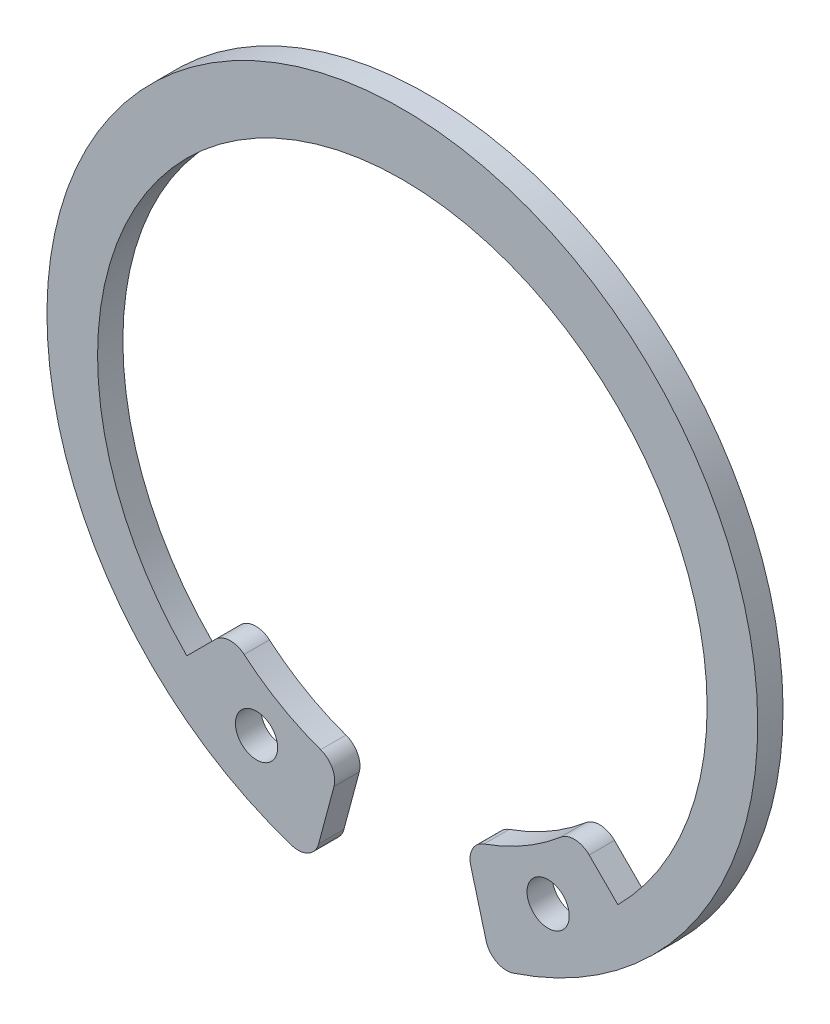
ISO-10303-21;
HEADER;
FILE_DESCRIPTION(('STEP AP214'),'2;1');
FILE_NAME('part.step','',(''),(''),'','','');
FILE_SCHEMA(('AUTOMOTIVE_DESIGN { 1 0 10303 214 1 1 1 1 }'));
ENDSEC;
DATA;
#1=APPLICATION_CONTEXT('core data for automotive mechanical design processes');
#2=APPLICATION_PROTOCOL_DEFINITION('international standard','automotive_design',2000,#1);
#3=PRODUCT_CONTEXT('',#1,'mechanical');
#4=PRODUCT('Part','Part','',(#3));
#5=PRODUCT_RELATED_PRODUCT_CATEGORY('part','',(#4));
#6=PRODUCT_DEFINITION_FORMATION('','',#4);
#7=PRODUCT_DEFINITION_CONTEXT('part definition',#1,'design');
#8=PRODUCT_DEFINITION('design','',#6,#7);
#9=PRODUCT_DEFINITION_SHAPE('','',#8);
#10=(LENGTH_UNIT() NAMED_UNIT(*) SI_UNIT(.MILLI.,.METRE.));
#11=(NAMED_UNIT(*) PLANE_ANGLE_UNIT() SI_UNIT($,.RADIAN.));
#12=(NAMED_UNIT(*) SI_UNIT($,.STERADIAN.) SOLID_ANGLE_UNIT());
#13=UNCERTAINTY_MEASURE_WITH_UNIT(LENGTH_MEASURE(1.E-05),#10,'distance_accuracy_value','');
#14=(GEOMETRIC_REPRESENTATION_CONTEXT(3) GLOBAL_UNCERTAINTY_ASSIGNED_CONTEXT((#13)) GLOBAL_UNIT_ASSIGNED_CONTEXT((#10,
#11,#12)) REPRESENTATION_CONTEXT('',''));
#15=CARTESIAN_POINT('',(0.,0.,0.));
#16=DIRECTION('',(0.,0.,1.));
#17=DIRECTION('',(1.,0.,0.));
#18=AXIS2_PLACEMENT_3D('',#15,#16,#17);
#19=CARTESIAN_POINT('',(8.15059978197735,-9.56481334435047,1.19999999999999));
#20=DIRECTION('',(0.,0.,-1.));
#21=DIRECTION('',(-1.,0.,0.));
#22=AXIS2_PLACEMENT_3D('',#19,#20,#21);
#23=PLANE('',#22);
#24=CARTESIAN_POINT('',(-6.91215514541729,-11.8388860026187,1.20000000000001));
#25=DIRECTION('',(0.,0.,1.));
#26=DIRECTION('',(1.,0.,0.));
#27=AXIS2_PLACEMENT_3D('',#24,#25,#26);
#28=CIRCLE('',#27,1.);
#29=CARTESIAN_POINT('',(-5.91215514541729,-11.8388860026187,1.20000000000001));
#30=VERTEX_POINT('',#29);
#31=EDGE_CURVE('E150',#30,#30,#28,.T.);
#32=ORIENTED_EDGE('',*,*,#31,.F.);
#33=EDGE_LOOP('',(#32));
#34=FACE_BOUND('',#33,.T.);
#35=CARTESIAN_POINT('',(8.15059978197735,-9.56481334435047,1.19999999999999));
#36=DIRECTION('',(0.,0.,1.));
#37=DIRECTION('',(-1.,0.,0.));
#38=AXIS2_PLACEMENT_3D('',#35,#36,#37);
#39=CIRCLE('',#38,1.);
#40=CARTESIAN_POINT('',(8.85770656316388,-8.85770656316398,1.20000000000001));
#41=VERTEX_POINT('',#40);
#42=CARTESIAN_POINT('',(7.50200440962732,-8.80367995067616,1.20000000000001));
#43=VERTEX_POINT('',#42);
#44=EDGE_CURVE('E180',#41,#43,#39,.T.);
#45=ORIENTED_EDGE('',*,*,#44,.T.);
#46=CARTESIAN_POINT('',(0.,0.,1.20000000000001));
#47=DIRECTION('',(0.,0.,-1.));
#48=DIRECTION('',(1.,0.,0.));
#49=AXIS2_PLACEMENT_3D('',#46,#47,#48);
#50=CIRCLE('',#49,11.5665401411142);
#51=CARTESIAN_POINT('',(3.87320827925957,-10.8987663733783,1.19999999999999));
#52=VERTEX_POINT('',#51);
#53=EDGE_CURVE('E145',#43,#52,#50,.T.);
#54=ORIENTED_EDGE('',*,*,#53,.T.);
#55=CARTESIAN_POINT('',(4.20807144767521,-11.8410331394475,1.20000000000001));
#56=DIRECTION('',(0.,0.,1.));
#57=DIRECTION('',(-1.,0.,0.));
#58=AXIS2_PLACEMENT_3D('',#55,#56,#57);
#59=CIRCLE('',#58,1.);
#60=CARTESIAN_POINT('',(3.24214562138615,-12.09985218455,1.20000000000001));
#61=VERTEX_POINT('',#60);
#62=EDGE_CURVE('E183',#52,#61,#59,.T.);
#63=ORIENTED_EDGE('',*,*,#62,.T.);
#64=DIRECTION('',(0.258819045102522,-0.96592582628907,0.));
#65=VECTOR('',#64,1.);
#66=CARTESIAN_POINT('',(3.9710889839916,-14.8203058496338,1.20000000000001));
#67=LINE('',#66,#65);
#68=CARTESIAN_POINT('',(3.9710889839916,-14.8203058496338,1.20000000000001));
#69=VERTEX_POINT('',#68);
#70=EDGE_CURVE('E185',#61,#69,#67,.T.);
#71=ORIENTED_EDGE('',*,*,#70,.T.);
#72=CARTESIAN_POINT('',(4.93701481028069,-14.5614868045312,1.20000000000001));
#73=DIRECTION('',(0.,0.,1.));
#74=DIRECTION('',(-1.,0.,0.));
#75=AXIS2_PLACEMENT_3D('',#72,#73,#74);
#76=CIRCLE('',#75,1.);
#77=CARTESIAN_POINT('',(5.24849839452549,-15.5117383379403,1.20000000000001));
#78=VERTEX_POINT('',#77);
#79=EDGE_CURVE('E187',#69,#78,#76,.T.);
#80=ORIENTED_EDGE('',*,*,#79,.T.);
#81=CARTESIAN_POINT('',(0.,0.5,1.20000000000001));
#82=DIRECTION('',(0.,0.,1.));
#83=DIRECTION('',(1.,0.,0.));
#84=AXIS2_PLACEMENT_3D('',#81,#82,#83);
#85=CIRCLE('',#84,16.85);
#86=CARTESIAN_POINT('',(-5.24849839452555,-15.5117383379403,1.20000000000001));
#87=VERTEX_POINT('',#86);
#88=EDGE_CURVE('E189',#78,#87,#85,.T.);
#89=ORIENTED_EDGE('',*,*,#88,.T.);
#90=CARTESIAN_POINT('',(-4.93701481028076,-14.5614868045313,1.20000000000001));
#91=DIRECTION('',(0.,0.,1.));
#92=DIRECTION('',(1.,0.,0.));
#93=AXIS2_PLACEMENT_3D('',#90,#91,#92);
#94=CIRCLE('',#93,1.);
#95=CARTESIAN_POINT('',(-3.97108898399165,-14.8203058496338,1.20000000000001));
#96=VERTEX_POINT('',#95);
#97=EDGE_CURVE('E191',#87,#96,#94,.T.);
#98=ORIENTED_EDGE('',*,*,#97,.T.);
#99=DIRECTION('',(0.258819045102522,0.965925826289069,0.));
#100=VECTOR('',#99,1.);
#101=CARTESIAN_POINT('',(-3.97108898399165,-14.8203058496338,1.20000000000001));
#102=LINE('',#101,#100);
#103=CARTESIAN_POINT('',(-3.24214562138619,-12.09985218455,1.19999999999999));
#104=VERTEX_POINT('',#103);
#105=EDGE_CURVE('E193',#96,#104,#102,.T.);
#106=ORIENTED_EDGE('',*,*,#105,.T.);
#107=CARTESIAN_POINT('',(-4.20807144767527,-11.8410331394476,1.19999999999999));
#108=DIRECTION('',(0.,0.,1.));
#109=DIRECTION('',(1.,0.,0.));
#110=AXIS2_PLACEMENT_3D('',#107,#108,#109);
#111=CIRCLE('',#110,1.);
#112=CARTESIAN_POINT('',(-3.87320827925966,-10.8987663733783,1.19999999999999));
#113=VERTEX_POINT('',#112);
#114=EDGE_CURVE('E195',#104,#113,#111,.T.);
#115=ORIENTED_EDGE('',*,*,#114,.T.);
#116=CARTESIAN_POINT('',(0.,0.,1.20000000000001));
#117=DIRECTION('',(0.,0.,-1.));
#118=DIRECTION('',(1.,0.,0.));
#119=AXIS2_PLACEMENT_3D('',#116,#117,#118);
#120=CIRCLE('',#119,11.5665401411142);
#121=CARTESIAN_POINT('',(-7.50200440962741,-8.80367995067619,1.20000000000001));
#122=VERTEX_POINT('',#121);
#123=EDGE_CURVE('E197',#113,#122,#120,.T.);
#124=ORIENTED_EDGE('',*,*,#123,.T.);
#125=CARTESIAN_POINT('',(-8.15059978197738,-9.56481334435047,1.20000000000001));
#126=DIRECTION('',(0.,0.,1.));
#127=DIRECTION('',(-1.,0.,0.));
#128=AXIS2_PLACEMENT_3D('',#125,#126,#127);
#129=CIRCLE('',#128,1.);
#130=CARTESIAN_POINT('',(-8.85770656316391,-8.85770656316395,1.19999999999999));
#131=VERTEX_POINT('',#130);
#132=EDGE_CURVE('E199',#122,#131,#129,.T.);
#133=ORIENTED_EDGE('',*,*,#132,.T.);
#134=DIRECTION('',(-0.70710678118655,-0.707106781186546,0.));
#135=VECTOR('',#134,1.);
#136=CARTESIAN_POINT('',(-8.85770656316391,-8.85770656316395,1.19999999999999));
#137=LINE('',#136,#135);
#138=CARTESIAN_POINT('',(-10.2176929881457,-10.2176929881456,1.20000000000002));
#139=VERTEX_POINT('',#138);
#140=EDGE_CURVE('E201',#131,#139,#137,.T.);
#141=ORIENTED_EDGE('',*,*,#140,.T.);
#142=CARTESIAN_POINT('',(0.,0.,1.20000000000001));
#143=DIRECTION('',(0.,0.,-1.));
#144=DIRECTION('',(1.,0.,0.));
#145=AXIS2_PLACEMENT_3D('',#142,#143,#144);
#146=CIRCLE('',#145,14.45);
#147=CARTESIAN_POINT('',(10.2176929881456,-10.2176929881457,1.20000000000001));
#148=VERTEX_POINT('',#147);
#149=EDGE_CURVE('E50',#139,#148,#146,.T.);
#150=ORIENTED_EDGE('',*,*,#149,.T.);
#151=DIRECTION('',(-0.70710678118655,0.707106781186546,0.));
#152=VECTOR('',#151,1.);
#153=CARTESIAN_POINT('',(8.85770656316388,-8.85770656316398,1.20000000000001));
#154=LINE('',#153,#152);
#155=EDGE_CURVE('E45',#148,#41,#154,.T.);
#156=ORIENTED_EDGE('',*,*,#155,.T.);
#157=EDGE_LOOP('',(#45,#54,#63,#71,#80,#89,#98,#106,#115,#124,#133,#141,#150,#156));
#158=FACE_BOUND('',#157,.T.);
#159=CARTESIAN_POINT('',(6.91215514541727,-11.8388860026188,1.20000000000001));
#160=DIRECTION('',(0.,0.,1.));
#161=DIRECTION('',(-1.,0.,0.));
#162=AXIS2_PLACEMENT_3D('',#159,#160,#161);
#163=CIRCLE('',#162,1.);
#164=CARTESIAN_POINT('',(5.91215514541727,-11.8388860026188,1.20000000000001));
#165=VERTEX_POINT('',#164);
#166=EDGE_CURVE('E320',#165,#165,#163,.T.);
#167=ORIENTED_EDGE('',*,*,#166,.F.);
#168=EDGE_LOOP('',(#167));
#169=FACE_BOUND('',#168,.T.);
#170=ADVANCED_FACE('F30',(#34,#158,#169),#23,.F.);
#171=CARTESIAN_POINT('',(8.15059978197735,-9.56481334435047,0.));
#172=DIRECTION('',(0.,0.,-1.));
#173=DIRECTION('',(-1.,0.,0.));
#174=AXIS2_PLACEMENT_3D('',#171,#172,#173);
#175=PLANE('',#174);
#176=CARTESIAN_POINT('',(-6.91215514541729,-11.8388860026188,0.));
#177=DIRECTION('',(0.,0.,1.));
#178=DIRECTION('',(1.,0.,0.));
#179=AXIS2_PLACEMENT_3D('',#176,#177,#178);
#180=CIRCLE('',#179,1.);
#181=CARTESIAN_POINT('',(-5.91215514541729,-11.8388860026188,0.));
#182=VERTEX_POINT('',#181);
#183=EDGE_CURVE('E153',#182,#182,#180,.T.);
#184=ORIENTED_EDGE('',*,*,#183,.T.);
#185=EDGE_LOOP('',(#184));
#186=FACE_BOUND('',#185,.T.);
#187=CARTESIAN_POINT('',(8.15059978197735,-9.56481334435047,0.));
#188=DIRECTION('',(0.,0.,1.));
#189=DIRECTION('',(-1.,0.,0.));
#190=AXIS2_PLACEMENT_3D('',#187,#188,#189);
#191=CIRCLE('',#190,1.);
#192=CARTESIAN_POINT('',(8.85770656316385,-8.8577065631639,0.));
#193=VERTEX_POINT('',#192);
#194=CARTESIAN_POINT('',(7.50200440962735,-8.80367995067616,0.));
#195=VERTEX_POINT('',#194);
#196=EDGE_CURVE('E136',#193,#195,#191,.T.);
#197=ORIENTED_EDGE('',*,*,#196,.F.);
#198=DIRECTION('',(-0.70710678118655,0.707106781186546,0.));
#199=VECTOR('',#198,1.);
#200=CARTESIAN_POINT('',(8.85770656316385,-8.8577065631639,0.));
#201=LINE('',#200,#199);
#202=CARTESIAN_POINT('',(10.2176929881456,-10.2176929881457,0.));
#203=VERTEX_POINT('',#202);
#204=EDGE_CURVE('E178',#203,#193,#201,.T.);
#205=ORIENTED_EDGE('',*,*,#204,.F.);
#206=CARTESIAN_POINT('',(0.,0.,0.));
#207=DIRECTION('',(0.,0.,-1.));
#208=DIRECTION('',(1.,0.,0.));
#209=AXIS2_PLACEMENT_3D('',#206,#207,#208);
#210=CIRCLE('',#209,14.45);
#211=CARTESIAN_POINT('',(-10.2176929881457,-10.2176929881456,0.));
#212=VERTEX_POINT('',#211);
#213=EDGE_CURVE('E176',#212,#203,#210,.T.);
#214=ORIENTED_EDGE('',*,*,#213,.F.);
#215=DIRECTION('',(-0.70710678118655,-0.707106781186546,0.));
#216=VECTOR('',#215,1.);
#217=CARTESIAN_POINT('',(-8.85770656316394,-8.85770656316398,0.));
#218=LINE('',#217,#216);
#219=CARTESIAN_POINT('',(-8.85770656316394,-8.85770656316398,0.));
#220=VERTEX_POINT('',#219);
#221=EDGE_CURVE('E174',#220,#212,#218,.T.);
#222=ORIENTED_EDGE('',*,*,#221,.F.);
#223=CARTESIAN_POINT('',(-8.15059978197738,-9.56481334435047,0.));
#224=DIRECTION('',(0.,0.,1.));
#225=DIRECTION('',(-1.,0.,0.));
#226=AXIS2_PLACEMENT_3D('',#223,#224,#225);
#227=CIRCLE('',#226,1.);
#228=CARTESIAN_POINT('',(-7.50200440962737,-8.80367995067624,0.));
#229=VERTEX_POINT('',#228);
#230=EDGE_CURVE('E172',#229,#220,#227,.T.);
#231=ORIENTED_EDGE('',*,*,#230,.F.);
#232=CARTESIAN_POINT('',(0.,0.,0.));
#233=DIRECTION('',(0.,0.,-1.));
#234=DIRECTION('',(1.,0.,0.));
#235=AXIS2_PLACEMENT_3D('',#232,#233,#234);
#236=CIRCLE('',#235,11.5665401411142);
#237=CARTESIAN_POINT('',(-3.87320827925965,-10.8987663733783,0.));
#238=VERTEX_POINT('',#237);
#239=EDGE_CURVE('E170',#238,#229,#236,.T.);
#240=ORIENTED_EDGE('',*,*,#239,.F.);
#241=CARTESIAN_POINT('',(-4.20807144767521,-11.8410331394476,0.));
#242=DIRECTION('',(0.,0.,1.));
#243=DIRECTION('',(1.,0.,0.));
#244=AXIS2_PLACEMENT_3D('',#241,#242,#243);
#245=CIRCLE('',#244,1.);
#246=CARTESIAN_POINT('',(-3.24214562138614,-12.09985218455,0.));
#247=VERTEX_POINT('',#246);
#248=EDGE_CURVE('E168',#247,#238,#245,.T.);
#249=ORIENTED_EDGE('',*,*,#248,.F.);
#250=DIRECTION('',(0.258819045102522,0.965925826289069,0.));
#251=VECTOR('',#250,1.);
#252=CARTESIAN_POINT('',(-3.97108898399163,-14.8203058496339,0.));
#253=LINE('',#252,#251);
#254=CARTESIAN_POINT('',(-3.97108898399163,-14.8203058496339,0.));
#255=VERTEX_POINT('',#254);
#256=EDGE_CURVE('E166',#255,#247,#253,.T.);
#257=ORIENTED_EDGE('',*,*,#256,.F.);
#258=CARTESIAN_POINT('',(-4.93701481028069,-14.5614868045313,0.));
#259=DIRECTION('',(0.,0.,1.));
#260=DIRECTION('',(1.,0.,0.));
#261=AXIS2_PLACEMENT_3D('',#258,#259,#260);
#262=CIRCLE('',#261,1.);
#263=CARTESIAN_POINT('',(-5.24849839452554,-15.5117383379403,0.));
#264=VERTEX_POINT('',#263);
#265=EDGE_CURVE('E164',#264,#255,#262,.T.);
#266=ORIENTED_EDGE('',*,*,#265,.F.);
#267=CARTESIAN_POINT('',(0.,0.5,0.));
#268=DIRECTION('',(0.,0.,1.));
#269=DIRECTION('',(1.,0.,0.));
#270=AXIS2_PLACEMENT_3D('',#267,#268,#269);
#271=CIRCLE('',#270,16.85);
#272=CARTESIAN_POINT('',(5.24849839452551,-15.5117383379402,0.));
#273=VERTEX_POINT('',#272);
#274=EDGE_CURVE('E162',#273,#264,#271,.T.);
#275=ORIENTED_EDGE('',*,*,#274,.F.);
#276=CARTESIAN_POINT('',(4.93701481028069,-14.5614868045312,0.));
#277=DIRECTION('',(0.,0.,1.));
#278=DIRECTION('',(-1.,0.,0.));
#279=AXIS2_PLACEMENT_3D('',#276,#277,#278);
#280=CIRCLE('',#279,1.);
#281=CARTESIAN_POINT('',(3.97108898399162,-14.8203058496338,0.));
#282=VERTEX_POINT('',#281);
#283=EDGE_CURVE('E160',#282,#273,#280,.T.);
#284=ORIENTED_EDGE('',*,*,#283,.F.);
#285=DIRECTION('',(0.258819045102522,-0.96592582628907,0.));
#286=VECTOR('',#285,1.);
#287=CARTESIAN_POINT('',(3.97108898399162,-14.8203058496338,0.));
#288=LINE('',#287,#286);
#289=CARTESIAN_POINT('',(3.24214562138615,-12.09985218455,0.));
#290=VERTEX_POINT('',#289);
#291=EDGE_CURVE('E158',#290,#282,#288,.T.);
#292=ORIENTED_EDGE('',*,*,#291,.F.);
#293=CARTESIAN_POINT('',(4.20807144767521,-11.8410331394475,0.));
#294=DIRECTION('',(0.,0.,1.));
#295=DIRECTION('',(-1.,0.,0.));
#296=AXIS2_PLACEMENT_3D('',#293,#294,#295);
#297=CIRCLE('',#296,1.);
#298=CARTESIAN_POINT('',(3.87320827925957,-10.8987663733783,0.));
#299=VERTEX_POINT('',#298);
#300=EDGE_CURVE('E138',#299,#290,#297,.T.);
#301=ORIENTED_EDGE('',*,*,#300,.F.);
#302=CARTESIAN_POINT('',(0.,0.,0.));
#303=DIRECTION('',(0.,0.,-1.));
#304=DIRECTION('',(1.,0.,0.));
#305=AXIS2_PLACEMENT_3D('',#302,#303,#304);
#306=CIRCLE('',#305,11.5665401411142);
#307=EDGE_CURVE('E131',#195,#299,#306,.T.);
#308=ORIENTED_EDGE('',*,*,#307,.F.);
#309=EDGE_LOOP('',(#197,#205,#214,#222,#231,#240,#249,#257,#266,#275,#284,#292,#301,#308));
#310=FACE_BOUND('',#309,.T.);
#311=CARTESIAN_POINT('',(6.91215514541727,-11.8388860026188,0.));
#312=DIRECTION('',(0.,0.,1.));
#313=DIRECTION('',(-1.,0.,0.));
#314=AXIS2_PLACEMENT_3D('',#311,#312,#313);
#315=CIRCLE('',#314,1.);
#316=CARTESIAN_POINT('',(5.91215514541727,-11.8388860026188,0.));
#317=VERTEX_POINT('',#316);
#318=EDGE_CURVE('E323',#317,#317,#315,.T.);
#319=ORIENTED_EDGE('',*,*,#318,.T.);
#320=EDGE_LOOP('',(#319));
#321=FACE_BOUND('',#320,.T.);
#322=ADVANCED_FACE('F132',(#186,#310,#321),#175,.T.);
#323=CARTESIAN_POINT('',(8.15059978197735,-9.56481334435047,1.19999999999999));
#324=DIRECTION('',(0.,0.,-1.));
#325=DIRECTION('',(-1.,0.,0.));
#326=AXIS2_PLACEMENT_3D('',#323,#324,#325);
#327=CYLINDRICAL_SURFACE('',#326,1.);
#328=ORIENTED_EDGE('',*,*,#196,.T.);
#329=DIRECTION('',(0.,0.,-1.));
#330=VECTOR('',#329,1.);
#331=CARTESIAN_POINT('',(7.50200440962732,-8.80367995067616,1.20000000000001));
#332=LINE('',#331,#330);
#333=EDGE_CURVE('E11',#43,#195,#332,.T.);
#334=ORIENTED_EDGE('',*,*,#333,.F.);
#335=ORIENTED_EDGE('',*,*,#44,.F.);
#336=DIRECTION('',(0.,0.,-1.));
#337=VECTOR('',#336,1.);
#338=CARTESIAN_POINT('',(8.85770656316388,-8.85770656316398,1.20000000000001));
#339=LINE('',#338,#337);
#340=EDGE_CURVE('E149',#41,#193,#339,.T.);
#341=ORIENTED_EDGE('',*,*,#340,.T.);
#342=EDGE_LOOP('',(#328,#334,#335,#341));
#343=FACE_BOUND('',#342,.T.);
#344=ADVANCED_FACE('F32',(#343),#327,.T.);
#345=CARTESIAN_POINT('',(0.,0.,1.20000000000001));
#346=DIRECTION('',(0.,0.,-1.));
#347=DIRECTION('',(-1.,0.,0.));
#348=AXIS2_PLACEMENT_3D('',#345,#346,#347);
#349=CYLINDRICAL_SURFACE('',#348,11.5665401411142);
#350=ORIENTED_EDGE('',*,*,#307,.T.);
#351=DIRECTION('',(0.,0.,-1.));
#352=VECTOR('',#351,1.);
#353=CARTESIAN_POINT('',(3.87320827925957,-10.8987663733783,1.19999999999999));
#354=LINE('',#353,#352);
#355=EDGE_CURVE('E38',#52,#299,#354,.T.);
#356=ORIENTED_EDGE('',*,*,#355,.F.);
#357=ORIENTED_EDGE('',*,*,#53,.F.);
#358=ORIENTED_EDGE('',*,*,#333,.T.);
#359=EDGE_LOOP('',(#350,#356,#357,#358));
#360=FACE_BOUND('',#359,.T.);
#361=ADVANCED_FACE('F144',(#360),#349,.F.);
#362=CARTESIAN_POINT('',(4.20807144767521,-11.8410331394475,1.20000000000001));
#363=DIRECTION('',(0.,0.,-1.));
#364=DIRECTION('',(-1.,0.,0.));
#365=AXIS2_PLACEMENT_3D('',#362,#363,#364);
#366=CYLINDRICAL_SURFACE('',#365,1.);
#367=ORIENTED_EDGE('',*,*,#300,.T.);
#368=DIRECTION('',(0.,0.,-1.));
#369=VECTOR('',#368,1.);
#370=CARTESIAN_POINT('',(3.24214562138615,-12.09985218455,1.20000000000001));
#371=LINE('',#370,#369);
#372=EDGE_CURVE('E236',#61,#290,#371,.T.);
#373=ORIENTED_EDGE('',*,*,#372,.F.);
#374=ORIENTED_EDGE('',*,*,#62,.F.);
#375=ORIENTED_EDGE('',*,*,#355,.T.);
#376=EDGE_LOOP('',(#367,#373,#374,#375));
#377=FACE_BOUND('',#376,.T.);
#378=ADVANCED_FACE('F240',(#377),#366,.T.);
#379=CARTESIAN_POINT('',(3.9710889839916,-14.8203058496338,1.20000000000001));
#380=DIRECTION('',(0.965925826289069,0.258819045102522,0.));
#381=DIRECTION('',(-0.258819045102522,0.96592582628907,0.));
#382=AXIS2_PLACEMENT_3D('',#379,#380,#381);
#383=PLANE('',#382);
#384=ORIENTED_EDGE('',*,*,#291,.T.);
#385=DIRECTION('',(0.,0.,-1.));
#386=VECTOR('',#385,1.);
#387=CARTESIAN_POINT('',(3.9710889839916,-14.8203058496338,1.20000000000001));
#388=LINE('',#387,#386);
#389=EDGE_CURVE('E233',#69,#282,#388,.T.);
#390=ORIENTED_EDGE('',*,*,#389,.F.);
#391=ORIENTED_EDGE('',*,*,#70,.F.);
#392=ORIENTED_EDGE('',*,*,#372,.T.);
#393=EDGE_LOOP('',(#384,#390,#391,#392));
#394=FACE_BOUND('',#393,.T.);
#395=ADVANCED_FACE('F248',(#394),#383,.F.);
#396=CARTESIAN_POINT('',(4.93701481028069,-14.5614868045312,1.20000000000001));
#397=DIRECTION('',(0.,0.,-1.));
#398=DIRECTION('',(-1.,0.,0.));
#399=AXIS2_PLACEMENT_3D('',#396,#397,#398);
#400=CYLINDRICAL_SURFACE('',#399,1.);
#401=ORIENTED_EDGE('',*,*,#283,.T.);
#402=DIRECTION('',(0.,0.,-1.));
#403=VECTOR('',#402,1.);
#404=CARTESIAN_POINT('',(5.24849839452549,-15.5117383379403,1.20000000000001));
#405=LINE('',#404,#403);
#406=EDGE_CURVE('E230',#78,#273,#405,.T.);
#407=ORIENTED_EDGE('',*,*,#406,.F.);
#408=ORIENTED_EDGE('',*,*,#79,.F.);
#409=ORIENTED_EDGE('',*,*,#389,.T.);
#410=EDGE_LOOP('',(#401,#407,#408,#409));
#411=FACE_BOUND('',#410,.T.);
#412=ADVANCED_FACE('F251',(#411),#400,.T.);
#413=CARTESIAN_POINT('',(0.,0.5,1.20000000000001));
#414=DIRECTION('',(0.,0.,-1.));
#415=DIRECTION('',(-1.,0.,0.));
#416=AXIS2_PLACEMENT_3D('',#413,#414,#415);
#417=CYLINDRICAL_SURFACE('',#416,16.85);
#418=ORIENTED_EDGE('',*,*,#274,.T.);
#419=DIRECTION('',(0.,0.,-1.));
#420=VECTOR('',#419,1.);
#421=CARTESIAN_POINT('',(-5.24849839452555,-15.5117383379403,1.20000000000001));
#422=LINE('',#421,#420);
#423=EDGE_CURVE('E227',#87,#264,#422,.T.);
#424=ORIENTED_EDGE('',*,*,#423,.F.);
#425=ORIENTED_EDGE('',*,*,#88,.F.);
#426=ORIENTED_EDGE('',*,*,#406,.T.);
#427=EDGE_LOOP('',(#418,#424,#425,#426));
#428=FACE_BOUND('',#427,.T.);
#429=ADVANCED_FACE('F256',(#428),#417,.T.);
#430=CARTESIAN_POINT('',(-4.93701481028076,-14.5614868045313,1.20000000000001));
#431=DIRECTION('',(0.,0.,-1.));
#432=DIRECTION('',(-1.,0.,0.));
#433=AXIS2_PLACEMENT_3D('',#430,#431,#432);
#434=CYLINDRICAL_SURFACE('',#433,1.);
#435=ORIENTED_EDGE('',*,*,#265,.T.);
#436=DIRECTION('',(0.,0.,-1.));
#437=VECTOR('',#436,1.);
#438=CARTESIAN_POINT('',(-3.97108898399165,-14.8203058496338,1.20000000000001));
#439=LINE('',#438,#437);
#440=EDGE_CURVE('E224',#96,#255,#439,.T.);
#441=ORIENTED_EDGE('',*,*,#440,.F.);
#442=ORIENTED_EDGE('',*,*,#97,.F.);
#443=ORIENTED_EDGE('',*,*,#423,.T.);
#444=EDGE_LOOP('',(#435,#441,#442,#443));
#445=FACE_BOUND('',#444,.T.);
#446=ADVANCED_FACE('F262',(#445),#434,.T.);
#447=CARTESIAN_POINT('',(-3.97108898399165,-14.8203058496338,1.20000000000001));
#448=DIRECTION('',(-0.965925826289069,0.258819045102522,0.));
#449=DIRECTION('',(-0.258819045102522,-0.965925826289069,0.));
#450=AXIS2_PLACEMENT_3D('',#447,#448,#449);
#451=PLANE('',#450);
#452=ORIENTED_EDGE('',*,*,#256,.T.);
#453=DIRECTION('',(0.,0.,-1.));
#454=VECTOR('',#453,1.);
#455=CARTESIAN_POINT('',(-3.24214562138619,-12.09985218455,1.19999999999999));
#456=LINE('',#455,#454);
#457=EDGE_CURVE('E221',#104,#247,#456,.T.);
#458=ORIENTED_EDGE('',*,*,#457,.F.);
#459=ORIENTED_EDGE('',*,*,#105,.F.);
#460=ORIENTED_EDGE('',*,*,#440,.T.);
#461=EDGE_LOOP('',(#452,#458,#459,#460));
#462=FACE_BOUND('',#461,.T.);
#463=ADVANCED_FACE('F266',(#462),#451,.F.);
#464=CARTESIAN_POINT('',(-4.20807144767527,-11.8410331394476,1.19999999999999));
#465=DIRECTION('',(0.,0.,-1.));
#466=DIRECTION('',(-1.,0.,0.));
#467=AXIS2_PLACEMENT_3D('',#464,#465,#466);
#468=CYLINDRICAL_SURFACE('',#467,1.);
#469=ORIENTED_EDGE('',*,*,#248,.T.);
#470=DIRECTION('',(0.,0.,-1.));
#471=VECTOR('',#470,1.);
#472=CARTESIAN_POINT('',(-3.87320827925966,-10.8987663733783,1.19999999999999));
#473=LINE('',#472,#471);
#474=EDGE_CURVE('E218',#113,#238,#473,.T.);
#475=ORIENTED_EDGE('',*,*,#474,.F.);
#476=ORIENTED_EDGE('',*,*,#114,.F.);
#477=ORIENTED_EDGE('',*,*,#457,.T.);
#478=EDGE_LOOP('',(#469,#475,#476,#477));
#479=FACE_BOUND('',#478,.T.);
#480=ADVANCED_FACE('F271',(#479),#468,.T.);
#481=CARTESIAN_POINT('',(0.,0.,1.20000000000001));
#482=DIRECTION('',(0.,0.,-1.));
#483=DIRECTION('',(-1.,0.,0.));
#484=AXIS2_PLACEMENT_3D('',#481,#482,#483);
#485=CYLINDRICAL_SURFACE('',#484,11.5665401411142);
#486=ORIENTED_EDGE('',*,*,#239,.T.);
#487=DIRECTION('',(0.,0.,-1.));
#488=VECTOR('',#487,1.);
#489=CARTESIAN_POINT('',(-7.50200440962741,-8.80367995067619,1.20000000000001));
#490=LINE('',#489,#488);
#491=EDGE_CURVE('E215',#122,#229,#490,.T.);
#492=ORIENTED_EDGE('',*,*,#491,.F.);
#493=ORIENTED_EDGE('',*,*,#123,.F.);
#494=ORIENTED_EDGE('',*,*,#474,.T.);
#495=EDGE_LOOP('',(#486,#492,#493,#494));
#496=FACE_BOUND('',#495,.T.);
#497=ADVANCED_FACE('F277',(#496),#485,.F.);
#498=CARTESIAN_POINT('',(-8.15059978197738,-9.56481334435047,1.20000000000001));
#499=DIRECTION('',(0.,0.,-1.));
#500=DIRECTION('',(-1.,0.,0.));
#501=AXIS2_PLACEMENT_3D('',#498,#499,#500);
#502=CYLINDRICAL_SURFACE('',#501,1.);
#503=ORIENTED_EDGE('',*,*,#230,.T.);
#504=DIRECTION('',(0.,0.,-1.));
#505=VECTOR('',#504,1.);
#506=CARTESIAN_POINT('',(-8.85770656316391,-8.85770656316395,1.19999999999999));
#507=LINE('',#506,#505);
#508=EDGE_CURVE('E212',#131,#220,#507,.T.);
#509=ORIENTED_EDGE('',*,*,#508,.F.);
#510=ORIENTED_EDGE('',*,*,#132,.F.);
#511=ORIENTED_EDGE('',*,*,#491,.T.);
#512=EDGE_LOOP('',(#503,#509,#510,#511));
#513=FACE_BOUND('',#512,.T.);
#514=ADVANCED_FACE('F281',(#513),#502,.T.);
#515=CARTESIAN_POINT('',(-8.85770656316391,-8.85770656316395,1.19999999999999));
#516=DIRECTION('',(0.707106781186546,-0.707106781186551,0.));
#517=DIRECTION('',(0.707106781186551,0.707106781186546,0.));
#518=AXIS2_PLACEMENT_3D('',#515,#516,#517);
#519=PLANE('',#518);
#520=ORIENTED_EDGE('',*,*,#221,.T.);
#521=DIRECTION('',(0.,0.,-1.));
#522=VECTOR('',#521,1.);
#523=CARTESIAN_POINT('',(-10.2176929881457,-10.2176929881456,1.20000000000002));
#524=LINE('',#523,#522);
#525=EDGE_CURVE('E209',#139,#212,#524,.T.);
#526=ORIENTED_EDGE('',*,*,#525,.F.);
#527=ORIENTED_EDGE('',*,*,#140,.F.);
#528=ORIENTED_EDGE('',*,*,#508,.T.);
#529=EDGE_LOOP('',(#520,#526,#527,#528));
#530=FACE_BOUND('',#529,.T.);
#531=ADVANCED_FACE('F286',(#530),#519,.F.);
#532=CARTESIAN_POINT('',(0.,0.,1.20000000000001));
#533=DIRECTION('',(0.,0.,-1.));
#534=DIRECTION('',(-1.,0.,0.));
#535=AXIS2_PLACEMENT_3D('',#532,#533,#534);
#536=CYLINDRICAL_SURFACE('',#535,14.45);
#537=ORIENTED_EDGE('',*,*,#213,.T.);
#538=DIRECTION('',(0.,0.,-1.));
#539=VECTOR('',#538,1.);
#540=CARTESIAN_POINT('',(10.2176929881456,-10.2176929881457,1.20000000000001));
#541=LINE('',#540,#539);
#542=EDGE_CURVE('E206',#148,#203,#541,.T.);
#543=ORIENTED_EDGE('',*,*,#542,.F.);
#544=ORIENTED_EDGE('',*,*,#149,.F.);
#545=ORIENTED_EDGE('',*,*,#525,.T.);
#546=EDGE_LOOP('',(#537,#543,#544,#545));
#547=FACE_BOUND('',#546,.T.);
#548=ADVANCED_FACE('F289',(#547),#536,.F.);
#549=CARTESIAN_POINT('',(8.85770656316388,-8.85770656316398,1.20000000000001));
#550=DIRECTION('',(-0.707106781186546,-0.70710678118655,0.));
#551=DIRECTION('',(0.70710678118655,-0.707106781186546,0.));
#552=AXIS2_PLACEMENT_3D('',#549,#550,#551);
#553=PLANE('',#552);
#554=ORIENTED_EDGE('',*,*,#204,.T.);
#555=ORIENTED_EDGE('',*,*,#340,.F.);
#556=ORIENTED_EDGE('',*,*,#155,.F.);
#557=ORIENTED_EDGE('',*,*,#542,.T.);
#558=EDGE_LOOP('',(#554,#555,#556,#557));
#559=FACE_BOUND('',#558,.T.);
#560=ADVANCED_FACE('F291',(#559),#553,.F.);
#561=CARTESIAN_POINT('',(-6.91215514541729,-11.8388860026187,1.20000000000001));
#562=DIRECTION('',(0.,0.,-1.));
#563=DIRECTION('',(-1.,0.,0.));
#564=AXIS2_PLACEMENT_3D('',#561,#562,#563);
#565=CYLINDRICAL_SURFACE('',#564,1.);
#566=ORIENTED_EDGE('',*,*,#31,.T.);
#567=EDGE_LOOP('',(#566));
#568=FACE_BOUND('',#567,.T.);
#569=ORIENTED_EDGE('',*,*,#183,.F.);
#570=EDGE_LOOP('',(#569));
#571=FACE_BOUND('',#570,.T.);
#572=ADVANCED_FACE('F293',(#568,#571),#565,.F.);
#573=CARTESIAN_POINT('',(6.91215514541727,-11.8388860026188,1.20000000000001));
#574=DIRECTION('',(0.,0.,-1.));
#575=DIRECTION('',(-1.,0.,0.));
#576=AXIS2_PLACEMENT_3D('',#573,#574,#575);
#577=CYLINDRICAL_SURFACE('',#576,1.);
#578=ORIENTED_EDGE('',*,*,#166,.T.);
#579=EDGE_LOOP('',(#578));
#580=FACE_BOUND('',#579,.T.);
#581=ORIENTED_EDGE('',*,*,#318,.F.);
#582=EDGE_LOOP('',(#581));
#583=FACE_BOUND('',#582,.T.);
#584=ADVANCED_FACE('F299',(#580,#583),#577,.F.);
#585=CLOSED_SHELL('',(#170,#322,#344,#361,#378,#395,#412,#429,#446,#463,#480,#497,#514,#531,
#548,#560,#572,#584));
#586=MANIFOLD_SOLID_BREP('B2',#585);
#587=ADVANCED_BREP_SHAPE_REPRESENTATION('',(#18,#586),#14);
#588=SHAPE_DEFINITION_REPRESENTATION(#9,#587);
ENDSEC;
END-ISO-10303-21;
